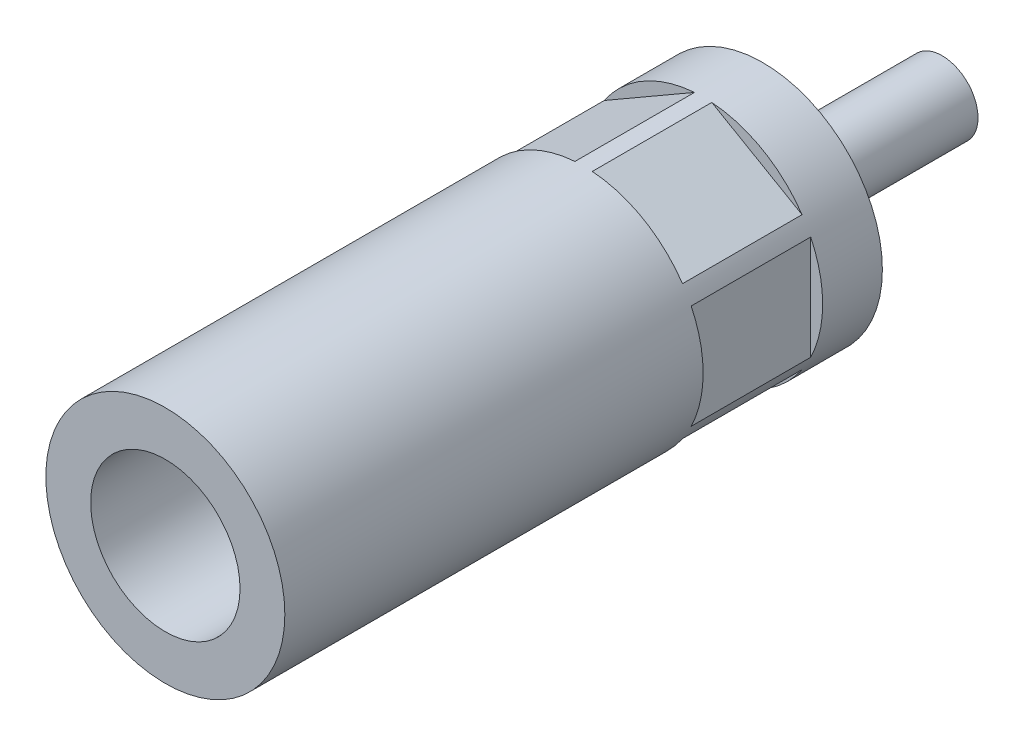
ISO-10303-21;
HEADER;
FILE_DESCRIPTION(('STEP AP214'),'2;1');
FILE_NAME('part.step','',(''),(''),'','','');
FILE_SCHEMA(('AUTOMOTIVE_DESIGN { 1 0 10303 214 1 1 1 1 }'));
ENDSEC;
DATA;
#1=APPLICATION_CONTEXT('core data for automotive mechanical design processes');
#2=APPLICATION_PROTOCOL_DEFINITION('international standard','automotive_design',2000,#1);
#3=PRODUCT_CONTEXT('',#1,'mechanical');
#4=PRODUCT('Part','Part','',(#3));
#5=PRODUCT_RELATED_PRODUCT_CATEGORY('part','',(#4));
#6=PRODUCT_DEFINITION_FORMATION('','',#4);
#7=PRODUCT_DEFINITION_CONTEXT('part definition',#1,'design');
#8=PRODUCT_DEFINITION('design','',#6,#7);
#9=PRODUCT_DEFINITION_SHAPE('','',#8);
#10=(LENGTH_UNIT() NAMED_UNIT(*) SI_UNIT(.MILLI.,.METRE.));
#11=(NAMED_UNIT(*) PLANE_ANGLE_UNIT() SI_UNIT($,.RADIAN.));
#12=(NAMED_UNIT(*) SI_UNIT($,.STERADIAN.) SOLID_ANGLE_UNIT());
#13=UNCERTAINTY_MEASURE_WITH_UNIT(LENGTH_MEASURE(1.E-05),#10,'distance_accuracy_value','');
#14=(GEOMETRIC_REPRESENTATION_CONTEXT(3) GLOBAL_UNCERTAINTY_ASSIGNED_CONTEXT((#13)) GLOBAL_UNIT_ASSIGNED_CONTEXT((#10,
#11,#12)) REPRESENTATION_CONTEXT('',''));
#15=CARTESIAN_POINT('',(0.,0.,0.));
#16=DIRECTION('',(0.,0.,1.));
#17=DIRECTION('',(1.,0.,0.));
#18=AXIS2_PLACEMENT_3D('',#15,#16,#17);
#19=CARTESIAN_POINT('',(0.,0.,80.));
#20=DIRECTION('',(0.,0.,1.));
#21=DIRECTION('',(1.,0.,0.));
#22=AXIS2_PLACEMENT_3D('',#19,#20,#21);
#23=CYLINDRICAL_SURFACE('',#22,20.);
#24=CARTESIAN_POINT('',(0.,0.,10.));
#25=DIRECTION('',(0.,0.,1.));
#26=DIRECTION('',(1.,0.,0.));
#27=AXIS2_PLACEMENT_3D('',#24,#25,#26);
#28=CIRCLE('',#27,20.);
#29=CARTESIAN_POINT('',(-16.5498344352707,-11.2295583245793,10.));
#30=VERTEX_POINT('',#29);
#31=CARTESIAN_POINT('',(-1.45016556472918,-19.9473562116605,10.));
#32=VERTEX_POINT('',#31);
#33=EDGE_CURVE('E153',#30,#32,#28,.T.);
#34=ORIENTED_EDGE('',*,*,#33,.F.);
#35=DIRECTION('',(0.,0.,1.));
#36=VECTOR('',#35,1.);
#37=CARTESIAN_POINT('',(-16.5498344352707,-11.2295583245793,80.));
#38=LINE('',#37,#36);
#39=CARTESIAN_POINT('',(-16.5498344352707,-11.2295583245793,30.));
#40=VERTEX_POINT('',#39);
#41=EDGE_CURVE('E9',#30,#40,#38,.T.);
#42=ORIENTED_EDGE('',*,*,#41,.T.);
#43=CARTESIAN_POINT('',(0.,0.,30.));
#44=DIRECTION('',(0.,0.,1.));
#45=DIRECTION('',(1.,0.,0.));
#46=AXIS2_PLACEMENT_3D('',#43,#44,#45);
#47=CIRCLE('',#46,20.);
#48=CARTESIAN_POINT('',(-1.45016556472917,-19.9473562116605,30.));
#49=VERTEX_POINT('',#48);
#50=EDGE_CURVE('E22',#40,#49,#47,.T.);
#51=ORIENTED_EDGE('',*,*,#50,.T.);
#52=DIRECTION('',(0.,0.,1.));
#53=VECTOR('',#52,1.);
#54=CARTESIAN_POINT('',(-1.45016556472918,-19.9473562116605,80.));
#55=LINE('',#54,#53);
#56=EDGE_CURVE('E150',#49,#32,#55,.F.);
#57=ORIENTED_EDGE('',*,*,#56,.T.);
#58=EDGE_LOOP('',(#34,#42,#51,#57));
#59=FACE_BOUND('',#58,.T.);
#60=DIRECTION('',(0.,0.,1.));
#61=VECTOR('',#60,1.);
#62=CARTESIAN_POINT('',(18.,8.71779788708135,80.));
#63=LINE('',#62,#61);
#64=CARTESIAN_POINT('',(18.,8.71779788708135,10.));
#65=VERTEX_POINT('',#64);
#66=CARTESIAN_POINT('',(18.,8.71779788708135,30.));
#67=VERTEX_POINT('',#66);
#68=EDGE_CURVE('E143',#65,#67,#63,.T.);
#69=ORIENTED_EDGE('',*,*,#68,.F.);
#70=CARTESIAN_POINT('',(18.,-8.71779788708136,10.));
#71=VERTEX_POINT('',#70);
#72=EDGE_CURVE('E142',#71,#65,#28,.T.);
#73=ORIENTED_EDGE('',*,*,#72,.F.);
#74=DIRECTION('',(0.,0.,1.));
#75=VECTOR('',#74,1.);
#76=CARTESIAN_POINT('',(18.,-8.71779788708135,80.));
#77=LINE('',#76,#75);
#78=CARTESIAN_POINT('',(18.,-8.71779788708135,30.));
#79=VERTEX_POINT('',#78);
#80=EDGE_CURVE('E139',#79,#71,#77,.F.);
#81=ORIENTED_EDGE('',*,*,#80,.F.);
#82=EDGE_CURVE('E146',#79,#67,#47,.T.);
#83=ORIENTED_EDGE('',*,*,#82,.T.);
#84=EDGE_LOOP('',(#69,#73,#81,#83));
#85=FACE_BOUND('',#84,.T.);
#86=CARTESIAN_POINT('',(16.5498344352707,11.2295583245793,10.));
#87=VERTEX_POINT('',#86);
#88=CARTESIAN_POINT('',(1.45016556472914,19.9473562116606,10.));
#89=VERTEX_POINT('',#88);
#90=EDGE_CURVE('E135',#87,#89,#28,.T.);
#91=ORIENTED_EDGE('',*,*,#90,.F.);
#92=DIRECTION('',(0.,0.,1.));
#93=VECTOR('',#92,1.);
#94=CARTESIAN_POINT('',(16.5498344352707,11.2295583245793,80.));
#95=LINE('',#94,#93);
#96=CARTESIAN_POINT('',(16.5498344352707,11.2295583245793,30.));
#97=VERTEX_POINT('',#96);
#98=EDGE_CURVE('E136',#87,#97,#95,.T.);
#99=ORIENTED_EDGE('',*,*,#98,.T.);
#100=CARTESIAN_POINT('',(1.45016556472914,19.9473562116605,30.));
#101=VERTEX_POINT('',#100);
#102=EDGE_CURVE('E140',#97,#101,#47,.T.);
#103=ORIENTED_EDGE('',*,*,#102,.T.);
#104=DIRECTION('',(0.,0.,1.));
#105=VECTOR('',#104,1.);
#106=CARTESIAN_POINT('',(1.45016556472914,19.9473562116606,80.));
#107=LINE('',#106,#105);
#108=EDGE_CURVE('E132',#101,#89,#107,.F.);
#109=ORIENTED_EDGE('',*,*,#108,.T.);
#110=EDGE_LOOP('',(#91,#99,#103,#109));
#111=FACE_BOUND('',#110,.T.);
#112=CARTESIAN_POINT('',(0.,0.,0.));
#113=DIRECTION('',(0.,0.,1.));
#114=DIRECTION('',(1.,0.,0.));
#115=AXIS2_PLACEMENT_3D('',#112,#113,#114);
#116=CIRCLE('',#115,20.);
#117=CARTESIAN_POINT('',(20.,0.,0.));
#118=VERTEX_POINT('',#117);
#119=EDGE_CURVE('E202',#118,#118,#116,.T.);
#120=ORIENTED_EDGE('',*,*,#119,.T.);
#121=EDGE_LOOP('',(#120));
#122=FACE_BOUND('',#121,.T.);
#123=CARTESIAN_POINT('',(0.,0.,100.));
#124=DIRECTION('',(0.,0.,1.));
#125=DIRECTION('',(1.,0.,0.));
#126=AXIS2_PLACEMENT_3D('',#123,#124,#125);
#127=CIRCLE('',#126,20.);
#128=CARTESIAN_POINT('',(20.,0.,100.));
#129=VERTEX_POINT('',#128);
#130=EDGE_CURVE('E205',#129,#129,#127,.T.);
#131=ORIENTED_EDGE('',*,*,#130,.F.);
#132=EDGE_LOOP('',(#131));
#133=FACE_BOUND('',#132,.T.);
#134=CARTESIAN_POINT('',(-18.,8.71779788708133,10.));
#135=VERTEX_POINT('',#134);
#136=CARTESIAN_POINT('',(-18.,-8.71779788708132,10.));
#137=VERTEX_POINT('',#136);
#138=EDGE_CURVE('E111',#135,#137,#28,.T.);
#139=ORIENTED_EDGE('',*,*,#138,.F.);
#140=DIRECTION('',(0.,0.,1.));
#141=VECTOR('',#140,1.);
#142=CARTESIAN_POINT('',(-18.,8.71779788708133,80.));
#143=LINE('',#142,#141);
#144=CARTESIAN_POINT('',(-18.,8.71779788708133,30.));
#145=VERTEX_POINT('',#144);
#146=EDGE_CURVE('E110',#135,#145,#143,.T.);
#147=ORIENTED_EDGE('',*,*,#146,.T.);
#148=CARTESIAN_POINT('',(-18.,-8.71779788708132,30.));
#149=VERTEX_POINT('',#148);
#150=EDGE_CURVE('E103',#145,#149,#47,.T.);
#151=ORIENTED_EDGE('',*,*,#150,.T.);
#152=DIRECTION('',(0.,0.,1.));
#153=VECTOR('',#152,1.);
#154=CARTESIAN_POINT('',(-18.,-8.71779788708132,80.));
#155=LINE('',#154,#153);
#156=EDGE_CURVE('E117',#149,#137,#155,.F.);
#157=ORIENTED_EDGE('',*,*,#156,.T.);
#158=EDGE_LOOP('',(#139,#147,#151,#157));
#159=FACE_BOUND('',#158,.T.);
#160=DIRECTION('',(0.,0.,1.));
#161=VECTOR('',#160,1.);
#162=CARTESIAN_POINT('',(-16.5498344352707,11.2295583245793,80.));
#163=LINE('',#162,#161);
#164=CARTESIAN_POINT('',(-16.5498344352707,11.2295583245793,10.));
#165=VERTEX_POINT('',#164);
#166=CARTESIAN_POINT('',(-16.5498344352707,11.2295583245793,30.));
#167=VERTEX_POINT('',#166);
#168=EDGE_CURVE('E130',#165,#167,#163,.T.);
#169=ORIENTED_EDGE('',*,*,#168,.F.);
#170=CARTESIAN_POINT('',(-1.45016556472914,19.9473562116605,10.));
#171=VERTEX_POINT('',#170);
#172=EDGE_CURVE('E126',#171,#165,#28,.T.);
#173=ORIENTED_EDGE('',*,*,#172,.F.);
#174=DIRECTION('',(0.,0.,1.));
#175=VECTOR('',#174,1.);
#176=CARTESIAN_POINT('',(-1.45016556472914,19.9473562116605,80.));
#177=LINE('',#176,#175);
#178=CARTESIAN_POINT('',(-1.45016556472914,19.9473562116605,30.));
#179=VERTEX_POINT('',#178);
#180=EDGE_CURVE('E124',#179,#171,#177,.F.);
#181=ORIENTED_EDGE('',*,*,#180,.F.);
#182=EDGE_CURVE('E113',#179,#167,#47,.T.);
#183=ORIENTED_EDGE('',*,*,#182,.T.);
#184=EDGE_LOOP('',(#169,#173,#181,#183));
#185=FACE_BOUND('',#184,.T.);
#186=DIRECTION('',(0.,0.,1.));
#187=VECTOR('',#186,1.);
#188=CARTESIAN_POINT('',(16.5498344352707,-11.2295583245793,80.));
#189=LINE('',#188,#187);
#190=CARTESIAN_POINT('',(16.5498344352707,-11.2295583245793,10.));
#191=VERTEX_POINT('',#190);
#192=CARTESIAN_POINT('',(16.5498344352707,-11.2295583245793,30.));
#193=VERTEX_POINT('',#192);
#194=EDGE_CURVE('E149',#191,#193,#189,.T.);
#195=ORIENTED_EDGE('',*,*,#194,.F.);
#196=CARTESIAN_POINT('',(1.45016556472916,-19.9473562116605,10.));
#197=VERTEX_POINT('',#196);
#198=EDGE_CURVE('E148',#197,#191,#28,.T.);
#199=ORIENTED_EDGE('',*,*,#198,.F.);
#200=DIRECTION('',(0.,0.,1.));
#201=VECTOR('',#200,1.);
#202=CARTESIAN_POINT('',(1.45016556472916,-19.9473562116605,80.));
#203=LINE('',#202,#201);
#204=CARTESIAN_POINT('',(1.45016556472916,-19.9473562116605,30.));
#205=VERTEX_POINT('',#204);
#206=EDGE_CURVE('E145',#205,#197,#203,.F.);
#207=ORIENTED_EDGE('',*,*,#206,.F.);
#208=EDGE_CURVE('E151',#205,#193,#47,.T.);
#209=ORIENTED_EDGE('',*,*,#208,.T.);
#210=EDGE_LOOP('',(#195,#199,#207,#209));
#211=FACE_BOUND('',#210,.T.);
#212=ADVANCED_FACE('F14',(#59,#85,#111,#122,#133,#159,#185,#211),#23,.T.);
#213=CARTESIAN_POINT('',(0.,0.,-30.));
#214=DIRECTION('',(0.,0.,1.));
#215=DIRECTION('',(1.,0.,0.));
#216=AXIS2_PLACEMENT_3D('',#213,#214,#215);
#217=PLANE('',#216);
#218=CARTESIAN_POINT('',(0.,0.,-30.));
#219=DIRECTION('',(0.,0.,1.));
#220=DIRECTION('',(1.,0.,0.));
#221=AXIS2_PLACEMENT_3D('',#218,#219,#220);
#222=CIRCLE('',#221,6.);
#223=CARTESIAN_POINT('',(6.,0.,-30.));
#224=VERTEX_POINT('',#223);
#225=EDGE_CURVE('E118',#224,#224,#222,.T.);
#226=ORIENTED_EDGE('',*,*,#225,.F.);
#227=EDGE_LOOP('',(#226));
#228=FACE_BOUND('',#227,.T.);
#229=ADVANCED_FACE('F16',(#228),#217,.F.);
#230=CARTESIAN_POINT('',(6.,0.,29.));
#231=DIRECTION('',(0.,0.,-1.));
#232=DIRECTION('',(-1.,0.,0.));
#233=AXIS2_PLACEMENT_3D('',#230,#231,#232);
#234=PLANE('',#233);
#235=CARTESIAN_POINT('',(0.,0.,29.));
#236=DIRECTION('',(0.,0.,1.));
#237=DIRECTION('',(1.,0.,0.));
#238=AXIS2_PLACEMENT_3D('',#235,#236,#237);
#239=CIRCLE('',#238,6.);
#240=CARTESIAN_POINT('',(6.,0.,29.));
#241=VERTEX_POINT('',#240);
#242=EDGE_CURVE('E160',#241,#241,#239,.T.);
#243=ORIENTED_EDGE('',*,*,#242,.T.);
#244=EDGE_LOOP('',(#243));
#245=FACE_BOUND('',#244,.T.);
#246=ADVANCED_FACE('F220',(#245),#234,.F.);
#247=CARTESIAN_POINT('',(0.,0.,80.));
#248=DIRECTION('',(0.,0.,1.));
#249=DIRECTION('',(1.,0.,0.));
#250=AXIS2_PLACEMENT_3D('',#247,#248,#249);
#251=CYLINDRICAL_SURFACE('',#250,6.);
#252=ORIENTED_EDGE('',*,*,#242,.F.);
#253=EDGE_LOOP('',(#252));
#254=FACE_BOUND('',#253,.T.);
#255=CARTESIAN_POINT('',(0.,0.,60.));
#256=DIRECTION('',(0.,0.,1.));
#257=DIRECTION('',(1.,0.,0.));
#258=AXIS2_PLACEMENT_3D('',#255,#256,#257);
#259=CIRCLE('',#258,6.);
#260=CARTESIAN_POINT('',(6.,0.,60.));
#261=VERTEX_POINT('',#260);
#262=EDGE_CURVE('E214',#261,#261,#259,.T.);
#263=ORIENTED_EDGE('',*,*,#262,.T.);
#264=EDGE_LOOP('',(#263));
#265=FACE_BOUND('',#264,.T.);
#266=ADVANCED_FACE('F222',(#254,#265),#251,.F.);
#267=CARTESIAN_POINT('',(6.,0.,60.));
#268=DIRECTION('',(0.,0.,1.));
#269=DIRECTION('',(1.,0.,0.));
#270=AXIS2_PLACEMENT_3D('',#267,#268,#269);
#271=PLANE('',#270);
#272=CARTESIAN_POINT('',(0.,0.,60.));
#273=DIRECTION('',(0.,0.,1.));
#274=DIRECTION('',(1.,0.,0.));
#275=AXIS2_PLACEMENT_3D('',#272,#273,#274);
#276=CIRCLE('',#275,12.5);
#277=CARTESIAN_POINT('',(12.5,0.,60.));
#278=VERTEX_POINT('',#277);
#279=EDGE_CURVE('E211',#278,#278,#276,.T.);
#280=ORIENTED_EDGE('',*,*,#279,.T.);
#281=EDGE_LOOP('',(#280));
#282=FACE_BOUND('',#281,.T.);
#283=ORIENTED_EDGE('',*,*,#262,.F.);
#284=EDGE_LOOP('',(#283));
#285=FACE_BOUND('',#284,.T.);
#286=ADVANCED_FACE('F225',(#282,#285),#271,.T.);
#287=CARTESIAN_POINT('',(0.,0.,80.));
#288=DIRECTION('',(0.,0.,1.));
#289=DIRECTION('',(1.,0.,0.));
#290=AXIS2_PLACEMENT_3D('',#287,#288,#289);
#291=CYLINDRICAL_SURFACE('',#290,12.5);
#292=ORIENTED_EDGE('',*,*,#279,.F.);
#293=EDGE_LOOP('',(#292));
#294=FACE_BOUND('',#293,.T.);
#295=CARTESIAN_POINT('',(0.,0.,100.));
#296=DIRECTION('',(0.,0.,1.));
#297=DIRECTION('',(1.,0.,0.));
#298=AXIS2_PLACEMENT_3D('',#295,#296,#297);
#299=CIRCLE('',#298,12.5);
#300=CARTESIAN_POINT('',(12.5,0.,100.));
#301=VERTEX_POINT('',#300);
#302=EDGE_CURVE('E208',#301,#301,#299,.T.);
#303=ORIENTED_EDGE('',*,*,#302,.T.);
#304=EDGE_LOOP('',(#303));
#305=FACE_BOUND('',#304,.T.);
#306=ADVANCED_FACE('F230',(#294,#305),#291,.F.);
#307=CARTESIAN_POINT('',(20.,0.,100.));
#308=DIRECTION('',(0.,0.,-1.));
#309=DIRECTION('',(-1.,0.,0.));
#310=AXIS2_PLACEMENT_3D('',#307,#308,#309);
#311=PLANE('',#310);
#312=ORIENTED_EDGE('',*,*,#302,.F.);
#313=EDGE_LOOP('',(#312));
#314=FACE_BOUND('',#313,.T.);
#315=ORIENTED_EDGE('',*,*,#130,.T.);
#316=EDGE_LOOP('',(#315));
#317=FACE_BOUND('',#316,.T.);
#318=ADVANCED_FACE('F238',(#314,#317),#311,.F.);
#319=CARTESIAN_POINT('',(20.,0.,0.));
#320=DIRECTION('',(0.,0.,-1.));
#321=DIRECTION('',(-1.,0.,0.));
#322=AXIS2_PLACEMENT_3D('',#319,#320,#321);
#323=PLANE('',#322);
#324=CARTESIAN_POINT('',(0.,0.,0.));
#325=DIRECTION('',(0.,0.,1.));
#326=DIRECTION('',(1.,0.,0.));
#327=AXIS2_PLACEMENT_3D('',#324,#325,#326);
#328=CIRCLE('',#327,6.);
#329=CARTESIAN_POINT('',(6.,0.,0.));
#330=VERTEX_POINT('',#329);
#331=EDGE_CURVE('E199',#330,#330,#328,.T.);
#332=ORIENTED_EDGE('',*,*,#331,.T.);
#333=EDGE_LOOP('',(#332));
#334=FACE_BOUND('',#333,.T.);
#335=ORIENTED_EDGE('',*,*,#119,.F.);
#336=EDGE_LOOP('',(#335));
#337=FACE_BOUND('',#336,.T.);
#338=ADVANCED_FACE('F250',(#334,#337),#323,.T.);
#339=CARTESIAN_POINT('',(0.,0.,80.));
#340=DIRECTION('',(0.,0.,1.));
#341=DIRECTION('',(1.,0.,0.));
#342=AXIS2_PLACEMENT_3D('',#339,#340,#341);
#343=CYLINDRICAL_SURFACE('',#342,6.);
#344=ORIENTED_EDGE('',*,*,#331,.F.);
#345=EDGE_LOOP('',(#344));
#346=FACE_BOUND('',#345,.T.);
#347=ORIENTED_EDGE('',*,*,#225,.T.);
#348=EDGE_LOOP('',(#347));
#349=FACE_BOUND('',#348,.T.);
#350=ADVANCED_FACE('F258',(#346,#349),#343,.T.);
#351=CARTESIAN_POINT('',(-18.,10.3923048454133,30.));
#352=DIRECTION('',(1.,0.,0.));
#353=DIRECTION('',(0.,1.,0.));
#354=AXIS2_PLACEMENT_3D('',#351,#352,#353);
#355=PLANE('',#354);
#356=DIRECTION('',(0.,-1.,0.));
#357=VECTOR('',#356,1.);
#358=CARTESIAN_POINT('',(-18.,10.3923048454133,10.));
#359=LINE('',#358,#357);
#360=EDGE_CURVE('E193',#135,#137,#359,.T.);
#361=ORIENTED_EDGE('',*,*,#360,.T.);
#362=ORIENTED_EDGE('',*,*,#156,.F.);
#363=DIRECTION('',(0.,-1.,0.));
#364=VECTOR('',#363,1.);
#365=CARTESIAN_POINT('',(-18.,10.3923048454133,30.));
#366=LINE('',#365,#364);
#367=EDGE_CURVE('E106',#145,#149,#366,.T.);
#368=ORIENTED_EDGE('',*,*,#367,.F.);
#369=ORIENTED_EDGE('',*,*,#146,.F.);
#370=EDGE_LOOP('',(#361,#362,#368,#369));
#371=FACE_BOUND('',#370,.T.);
#372=ADVANCED_FACE('F115',(#371),#355,.F.);
#373=CARTESIAN_POINT('',(0.,0.,10.));
#374=DIRECTION('',(0.,0.,1.));
#375=DIRECTION('',(1.,0.,0.));
#376=AXIS2_PLACEMENT_3D('',#373,#374,#375);
#377=PLANE('',#376);
#378=ORIENTED_EDGE('',*,*,#138,.T.);
#379=ORIENTED_EDGE('',*,*,#360,.F.);
#380=EDGE_LOOP('',(#378,#379));
#381=FACE_BOUND('',#380,.T.);
#382=ADVANCED_FACE('F280',(#381),#377,.T.);
#383=CARTESIAN_POINT('',(0.,0.,30.));
#384=DIRECTION('',(0.,0.,1.));
#385=DIRECTION('',(1.,0.,0.));
#386=AXIS2_PLACEMENT_3D('',#383,#384,#385);
#387=PLANE('',#386);
#388=ORIENTED_EDGE('',*,*,#367,.T.);
#389=ORIENTED_EDGE('',*,*,#150,.F.);
#390=EDGE_LOOP('',(#388,#389));
#391=FACE_BOUND('',#390,.T.);
#392=ADVANCED_FACE('F105',(#391),#387,.F.);
#393=CARTESIAN_POINT('',(-18.,10.3923048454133,30.));
#394=DIRECTION('',(-0.5,0.866025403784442,0.));
#395=DIRECTION('',(-0.866025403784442,-0.5,0.));
#396=AXIS2_PLACEMENT_3D('',#393,#394,#395);
#397=PLANE('',#396);
#398=ORIENTED_EDGE('',*,*,#168,.T.);
#399=DIRECTION('',(0.866025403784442,0.5,0.));
#400=VECTOR('',#399,1.);
#401=CARTESIAN_POINT('',(-18.,10.3923048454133,30.));
#402=LINE('',#401,#400);
#403=EDGE_CURVE('E119',#167,#179,#402,.T.);
#404=ORIENTED_EDGE('',*,*,#403,.T.);
#405=ORIENTED_EDGE('',*,*,#180,.T.);
#406=DIRECTION('',(0.866025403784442,0.5,0.));
#407=VECTOR('',#406,1.);
#408=CARTESIAN_POINT('',(-18.,10.3923048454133,10.));
#409=LINE('',#408,#407);
#410=EDGE_CURVE('E344',#165,#171,#409,.T.);
#411=ORIENTED_EDGE('',*,*,#410,.F.);
#412=EDGE_LOOP('',(#398,#404,#405,#411));
#413=FACE_BOUND('',#412,.T.);
#414=ADVANCED_FACE('F306',(#413),#397,.T.);
#415=ORIENTED_EDGE('',*,*,#172,.T.);
#416=ORIENTED_EDGE('',*,*,#410,.T.);
#417=EDGE_LOOP('',(#415,#416));
#418=FACE_BOUND('',#417,.T.);
#419=ADVANCED_FACE('F294',(#418),#377,.T.);
#420=ORIENTED_EDGE('',*,*,#403,.F.);
#421=ORIENTED_EDGE('',*,*,#182,.F.);
#422=EDGE_LOOP('',(#420,#421));
#423=FACE_BOUND('',#422,.T.);
#424=ADVANCED_FACE('F289',(#423),#387,.F.);
#425=CARTESIAN_POINT('',(18.,10.3923048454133,30.));
#426=DIRECTION('',(-0.499999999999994,-0.866025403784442,0.));
#427=DIRECTION('',(0.866025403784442,-0.499999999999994,0.));
#428=AXIS2_PLACEMENT_3D('',#425,#426,#427);
#429=PLANE('',#428);
#430=DIRECTION('',(-0.866025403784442,0.499999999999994,0.));
#431=VECTOR('',#430,1.);
#432=CARTESIAN_POINT('',(18.,10.3923048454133,10.));
#433=LINE('',#432,#431);
#434=EDGE_CURVE('E345',#87,#89,#433,.T.);
#435=ORIENTED_EDGE('',*,*,#434,.T.);
#436=ORIENTED_EDGE('',*,*,#108,.F.);
#437=DIRECTION('',(-0.866025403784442,0.499999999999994,0.));
#438=VECTOR('',#437,1.);
#439=CARTESIAN_POINT('',(18.,10.3923048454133,30.));
#440=LINE('',#439,#438);
#441=EDGE_CURVE('E190',#97,#101,#440,.T.);
#442=ORIENTED_EDGE('',*,*,#441,.F.);
#443=ORIENTED_EDGE('',*,*,#98,.F.);
#444=EDGE_LOOP('',(#435,#436,#442,#443));
#445=FACE_BOUND('',#444,.T.);
#446=ADVANCED_FACE('F293',(#445),#429,.F.);
#447=ORIENTED_EDGE('',*,*,#90,.T.);
#448=ORIENTED_EDGE('',*,*,#434,.F.);
#449=EDGE_LOOP('',(#447,#448));
#450=FACE_BOUND('',#449,.T.);
#451=ADVANCED_FACE('F287',(#450),#377,.T.);
#452=ORIENTED_EDGE('',*,*,#441,.T.);
#453=ORIENTED_EDGE('',*,*,#102,.F.);
#454=EDGE_LOOP('',(#452,#453));
#455=FACE_BOUND('',#454,.T.);
#456=ADVANCED_FACE('F283',(#455),#387,.F.);
#457=CARTESIAN_POINT('',(18.,10.3923048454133,30.));
#458=DIRECTION('',(1.,0.,0.));
#459=DIRECTION('',(0.,1.,0.));
#460=AXIS2_PLACEMENT_3D('',#457,#458,#459);
#461=PLANE('',#460);
#462=ORIENTED_EDGE('',*,*,#68,.T.);
#463=DIRECTION('',(0.,-1.,0.));
#464=VECTOR('',#463,1.);
#465=CARTESIAN_POINT('',(18.,10.3923048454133,30.));
#466=LINE('',#465,#464);
#467=EDGE_CURVE('E187',#67,#79,#466,.T.);
#468=ORIENTED_EDGE('',*,*,#467,.T.);
#469=ORIENTED_EDGE('',*,*,#80,.T.);
#470=DIRECTION('',(0.,-1.,0.));
#471=VECTOR('',#470,1.);
#472=CARTESIAN_POINT('',(18.,10.3923048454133,10.));
#473=LINE('',#472,#471);
#474=EDGE_CURVE('E348',#65,#71,#473,.T.);
#475=ORIENTED_EDGE('',*,*,#474,.F.);
#476=EDGE_LOOP('',(#462,#468,#469,#475));
#477=FACE_BOUND('',#476,.T.);
#478=ADVANCED_FACE('F286',(#477),#461,.T.);
#479=ORIENTED_EDGE('',*,*,#72,.T.);
#480=ORIENTED_EDGE('',*,*,#474,.T.);
#481=EDGE_LOOP('',(#479,#480));
#482=FACE_BOUND('',#481,.T.);
#483=ADVANCED_FACE('F295',(#482),#377,.T.);
#484=ORIENTED_EDGE('',*,*,#467,.F.);
#485=ORIENTED_EDGE('',*,*,#82,.F.);
#486=EDGE_LOOP('',(#484,#485));
#487=FACE_BOUND('',#486,.T.);
#488=ADVANCED_FACE('F290',(#487),#387,.F.);
#489=CARTESIAN_POINT('',(18.,-10.3923048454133,30.));
#490=DIRECTION('',(0.5,-0.866025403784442,0.));
#491=DIRECTION('',(0.866025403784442,0.5,0.));
#492=AXIS2_PLACEMENT_3D('',#489,#490,#491);
#493=PLANE('',#492);
#494=ORIENTED_EDGE('',*,*,#194,.T.);
#495=DIRECTION('',(-0.866025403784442,-0.5,0.));
#496=VECTOR('',#495,1.);
#497=CARTESIAN_POINT('',(18.,-10.3923048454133,30.));
#498=LINE('',#497,#496);
#499=EDGE_CURVE('E37',#193,#205,#498,.T.);
#500=ORIENTED_EDGE('',*,*,#499,.T.);
#501=ORIENTED_EDGE('',*,*,#206,.T.);
#502=DIRECTION('',(-0.866025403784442,-0.5,0.));
#503=VECTOR('',#502,1.);
#504=CARTESIAN_POINT('',(18.,-10.3923048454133,10.));
#505=LINE('',#504,#503);
#506=EDGE_CURVE('E352',#191,#197,#505,.T.);
#507=ORIENTED_EDGE('',*,*,#506,.F.);
#508=EDGE_LOOP('',(#494,#500,#501,#507));
#509=FACE_BOUND('',#508,.T.);
#510=ADVANCED_FACE('F296',(#509),#493,.T.);
#511=ORIENTED_EDGE('',*,*,#198,.T.);
#512=ORIENTED_EDGE('',*,*,#506,.T.);
#513=EDGE_LOOP('',(#511,#512));
#514=FACE_BOUND('',#513,.T.);
#515=ADVANCED_FACE('F299',(#514),#377,.T.);
#516=ORIENTED_EDGE('',*,*,#499,.F.);
#517=ORIENTED_EDGE('',*,*,#208,.F.);
#518=EDGE_LOOP('',(#516,#517));
#519=FACE_BOUND('',#518,.T.);
#520=ADVANCED_FACE('F186',(#519),#387,.F.);
#521=DIRECTION('',(0.866025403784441,-0.5,0.));
#522=VECTOR('',#521,1.);
#523=CARTESIAN_POINT('',(-18.,-10.3923048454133,30.));
#524=LINE('',#523,#522);
#525=EDGE_CURVE('E188',#40,#49,#524,.T.);
#526=ORIENTED_EDGE('',*,*,#525,.T.);
#527=ORIENTED_EDGE('',*,*,#50,.F.);
#528=EDGE_LOOP('',(#526,#527));
#529=FACE_BOUND('',#528,.T.);
#530=ADVANCED_FACE('F317',(#529),#387,.F.);
#531=ORIENTED_EDGE('',*,*,#33,.T.);
#532=DIRECTION('',(0.866025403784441,-0.5,0.));
#533=VECTOR('',#532,1.);
#534=CARTESIAN_POINT('',(-18.,-10.3923048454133,10.));
#535=LINE('',#534,#533);
#536=EDGE_CURVE('E29',#30,#32,#535,.T.);
#537=ORIENTED_EDGE('',*,*,#536,.F.);
#538=EDGE_LOOP('',(#531,#537));
#539=FACE_BOUND('',#538,.T.);
#540=ADVANCED_FACE('F312',(#539),#377,.T.);
#541=CARTESIAN_POINT('',(-18.,-10.3923048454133,30.));
#542=DIRECTION('',(0.5,0.866025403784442,0.));
#543=DIRECTION('',(-0.866025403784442,0.5,0.));
#544=AXIS2_PLACEMENT_3D('',#541,#542,#543);
#545=PLANE('',#544);
#546=ORIENTED_EDGE('',*,*,#536,.T.);
#547=ORIENTED_EDGE('',*,*,#56,.F.);
#548=ORIENTED_EDGE('',*,*,#525,.F.);
#549=ORIENTED_EDGE('',*,*,#41,.F.);
#550=EDGE_LOOP('',(#546,#547,#548,#549));
#551=FACE_BOUND('',#550,.T.);
#552=ADVANCED_FACE('F310',(#551),#545,.F.);
#553=CLOSED_SHELL('',(#212,#229,#246,#266,#286,#306,#318,#338,#350,#372,#382,#392,#414,#419,
#424,#446,#451,#456,#478,#483,#488,#510,#515,#520,#530,#540,#552));
#554=MANIFOLD_SOLID_BREP('B1',#553);
#555=ADVANCED_BREP_SHAPE_REPRESENTATION('',(#18,#554),#14);
#556=SHAPE_DEFINITION_REPRESENTATION(#9,#555);
ENDSEC;
END-ISO-10303-21;
